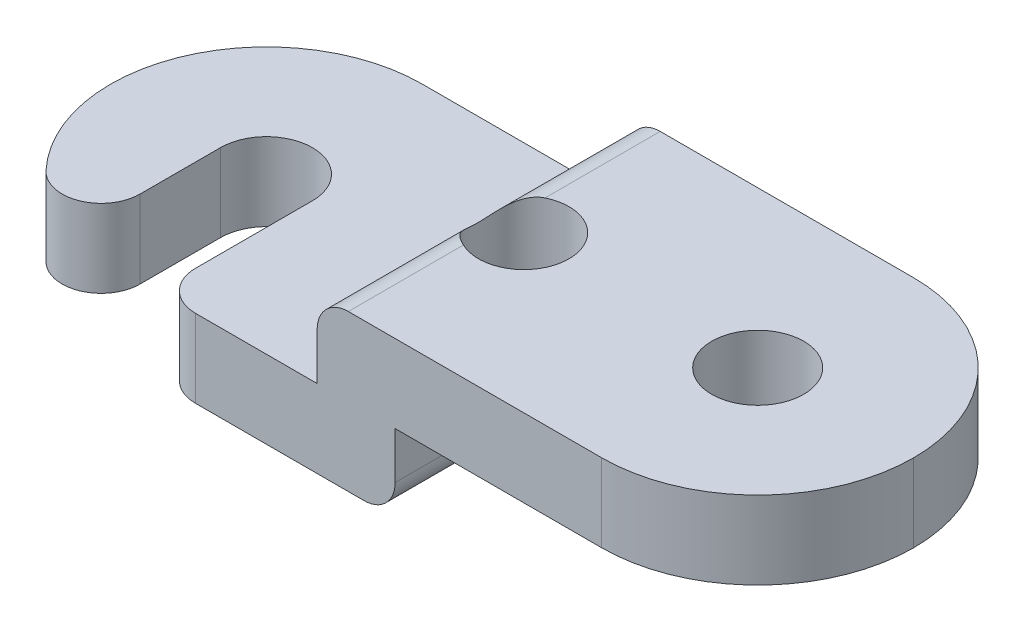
ISO-10303-21;
HEADER;
FILE_DESCRIPTION(('STEP AP214'),'2;1');
FILE_NAME('part.step','',(''),(''),'','','');
FILE_SCHEMA(('AUTOMOTIVE_DESIGN { 1 0 10303 214 1 1 1 1 }'));
ENDSEC;
DATA;
#1=APPLICATION_CONTEXT('core data for automotive mechanical design processes');
#2=APPLICATION_PROTOCOL_DEFINITION('international standard','automotive_design',2000,#1);
#3=PRODUCT_CONTEXT('',#1,'mechanical');
#4=PRODUCT('Part','Part','',(#3));
#5=PRODUCT_RELATED_PRODUCT_CATEGORY('part','',(#4));
#6=PRODUCT_DEFINITION_FORMATION('','',#4);
#7=PRODUCT_DEFINITION_CONTEXT('part definition',#1,'design');
#8=PRODUCT_DEFINITION('design','',#6,#7);
#9=PRODUCT_DEFINITION_SHAPE('','',#8);
#10=(LENGTH_UNIT() NAMED_UNIT(*) SI_UNIT(.MILLI.,.METRE.));
#11=(NAMED_UNIT(*) PLANE_ANGLE_UNIT() SI_UNIT($,.RADIAN.));
#12=(NAMED_UNIT(*) SI_UNIT($,.STERADIAN.) SOLID_ANGLE_UNIT());
#13=UNCERTAINTY_MEASURE_WITH_UNIT(LENGTH_MEASURE(1.E-05),#10,'distance_accuracy_value','');
#14=(GEOMETRIC_REPRESENTATION_CONTEXT(3) GLOBAL_UNCERTAINTY_ASSIGNED_CONTEXT((#13)) GLOBAL_UNIT_ASSIGNED_CONTEXT((#10,
#11,#12)) REPRESENTATION_CONTEXT('',''));
#15=CARTESIAN_POINT('',(0.,0.,0.));
#16=DIRECTION('',(0.,0.,1.));
#17=DIRECTION('',(1.,0.,0.));
#18=AXIS2_PLACEMENT_3D('',#15,#16,#17);
#19=CARTESIAN_POINT('',(5.15,2.,2.00000000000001));
#20=DIRECTION('',(0.,0.,-1.));
#21=DIRECTION('',(-1.,0.,0.));
#22=AXIS2_PLACEMENT_3D('',#19,#20,#21);
#23=PLANE('',#22);
#24=DIRECTION('',(1.,0.,0.));
#25=VECTOR('',#24,1.);
#26=CARTESIAN_POINT('',(-0.499999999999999,1.,2.00000000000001));
#27=LINE('',#26,#25);
#28=CARTESIAN_POINT('',(-2.06,1.,2.00000000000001));
#29=VERTEX_POINT('',#28);
#30=CARTESIAN_POINT('',(-0.499999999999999,1.,2.00000000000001));
#31=VERTEX_POINT('',#30);
#32=EDGE_CURVE('E266',#29,#31,#27,.T.);
#33=ORIENTED_EDGE('',*,*,#32,.F.);
#34=DIRECTION('',(0.,1.,0.));
#35=VECTOR('',#34,1.);
#36=CARTESIAN_POINT('',(-2.06,0.,2.00000000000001));
#37=LINE('',#36,#35);
#38=CARTESIAN_POINT('',(-2.06,0.,2.00000000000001));
#39=VERTEX_POINT('',#38);
#40=EDGE_CURVE('E51',#29,#39,#37,.F.);
#41=ORIENTED_EDGE('',*,*,#40,.T.);
#42=DIRECTION('',(1.,0.,0.));
#43=VECTOR('',#42,1.);
#44=CARTESIAN_POINT('',(5.15,0.,2.00000000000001));
#45=LINE('',#44,#43);
#46=CARTESIAN_POINT('',(0.1,0.,2.00000000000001));
#47=VERTEX_POINT('',#46);
#48=EDGE_CURVE('E263',#39,#47,#45,.T.);
#49=ORIENTED_EDGE('',*,*,#48,.T.);
#50=CARTESIAN_POINT('',(0.1,0.4,2.00000000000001));
#51=DIRECTION('',(0.,0.,-1.));
#52=DIRECTION('',(-1.,0.,0.));
#53=AXIS2_PLACEMENT_3D('',#50,#51,#52);
#54=CIRCLE('',#53,0.4);
#55=CARTESIAN_POINT('',(0.5,0.4,2.00000000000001));
#56=VERTEX_POINT('',#55);
#57=EDGE_CURVE('E340',#47,#56,#54,.F.);
#58=ORIENTED_EDGE('',*,*,#57,.T.);
#59=DIRECTION('',(0.,-1.,0.));
#60=VECTOR('',#59,1.);
#61=CARTESIAN_POINT('',(0.5,1.,2.00000000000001));
#62=LINE('',#61,#60);
#63=CARTESIAN_POINT('',(0.5,1.,2.00000000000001));
#64=VERTEX_POINT('',#63);
#65=EDGE_CURVE('E348',#64,#56,#62,.T.);
#66=ORIENTED_EDGE('',*,*,#65,.F.);
#67=DIRECTION('',(-1.,0.,0.));
#68=VECTOR('',#67,1.);
#69=CARTESIAN_POINT('',(3.15,1.,2.00000000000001));
#70=LINE('',#69,#68);
#71=CARTESIAN_POINT('',(3.15,1.,2.00000000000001));
#72=VERTEX_POINT('',#71);
#73=EDGE_CURVE('E192',#72,#64,#70,.T.);
#74=ORIENTED_EDGE('',*,*,#73,.F.);
#75=DIRECTION('',(0.,-1.,0.));
#76=VECTOR('',#75,1.);
#77=CARTESIAN_POINT('',(3.15,2.,2.00000000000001));
#78=LINE('',#77,#76);
#79=CARTESIAN_POINT('',(3.15,2.,2.00000000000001));
#80=VERTEX_POINT('',#79);
#81=EDGE_CURVE('E315',#72,#80,#78,.F.);
#82=ORIENTED_EDGE('',*,*,#81,.T.);
#83=DIRECTION('',(1.,0.,0.));
#84=VECTOR('',#83,1.);
#85=CARTESIAN_POINT('',(5.15,2.,2.00000000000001));
#86=LINE('',#85,#84);
#87=CARTESIAN_POINT('',(-0.0999999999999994,2.,2.00000000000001));
#88=VERTEX_POINT('',#87);
#89=EDGE_CURVE('E302',#88,#80,#86,.T.);
#90=ORIENTED_EDGE('',*,*,#89,.F.);
#91=CARTESIAN_POINT('',(-0.0999999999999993,1.6,2.00000000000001));
#92=DIRECTION('',(0.,0.,-1.));
#93=DIRECTION('',(-1.,0.,0.));
#94=AXIS2_PLACEMENT_3D('',#91,#92,#93);
#95=CIRCLE('',#94,0.4);
#96=CARTESIAN_POINT('',(-0.499999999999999,1.6,2.00000000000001));
#97=VERTEX_POINT('',#96);
#98=EDGE_CURVE('E296',#88,#97,#95,.F.);
#99=ORIENTED_EDGE('',*,*,#98,.T.);
#100=DIRECTION('',(0.,1.,0.));
#101=VECTOR('',#100,1.);
#102=CARTESIAN_POINT('',(-0.499999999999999,1.,2.00000000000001));
#103=LINE('',#102,#101);
#104=EDGE_CURVE('E288',#31,#97,#103,.T.);
#105=ORIENTED_EDGE('',*,*,#104,.F.);
#106=EDGE_LOOP('',(#33,#41,#49,#58,#66,#74,#82,#90,#99,#105));
#107=FACE_BOUND('',#106,.T.);
#108=ADVANCED_FACE('F38',(#107),#23,.F.);
#109=CARTESIAN_POINT('',(-5.15,0.,-1.99999999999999));
#110=DIRECTION('',(0.,1.,0.));
#111=DIRECTION('',(0.,0.,1.));
#112=AXIS2_PLACEMENT_3D('',#109,#110,#111);
#113=PLANE('',#112);
#114=DIRECTION('',(0.,0.,-1.));
#115=VECTOR('',#114,1.);
#116=CARTESIAN_POINT('',(-3.74,0.,-1.99999999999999));
#117=LINE('',#116,#115);
#118=CARTESIAN_POINT('',(-3.74,0.,1.03048532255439));
#119=VERTEX_POINT('',#118);
#120=CARTESIAN_POINT('',(-3.74,0.,0.));
#121=VERTEX_POINT('',#120);
#122=EDGE_CURVE('E207',#119,#121,#117,.T.);
#123=ORIENTED_EDGE('',*,*,#122,.F.);
#124=CARTESIAN_POINT('',(-4.24,0.,1.03048532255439));
#125=DIRECTION('',(0.,1.,0.));
#126=DIRECTION('',(0.,0.,1.));
#127=AXIS2_PLACEMENT_3D('',#124,#125,#126);
#128=CIRCLE('',#127,0.5);
#129=CARTESIAN_POINT('',(-4.60333333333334,0.,1.37398043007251));
#130=VERTEX_POINT('',#129);
#131=EDGE_CURVE('E257',#119,#130,#128,.F.);
#132=ORIENTED_EDGE('',*,*,#131,.T.);
#133=CARTESIAN_POINT('',(-3.15,0.,0.));
#134=DIRECTION('',(0.,1.,0.));
#135=DIRECTION('',(0.,0.,1.));
#136=AXIS2_PLACEMENT_3D('',#133,#134,#135);
#137=CIRCLE('',#136,2.);
#138=CARTESIAN_POINT('',(-5.15,0.,0.));
#139=VERTEX_POINT('',#138);
#140=EDGE_CURVE('E318',#130,#139,#137,.F.);
#141=ORIENTED_EDGE('',*,*,#140,.T.);
#142=CARTESIAN_POINT('',(-3.15,0.,0.));
#143=DIRECTION('',(0.,1.,0.));
#144=DIRECTION('',(0.,0.,1.));
#145=AXIS2_PLACEMENT_3D('',#142,#143,#144);
#146=CIRCLE('',#145,2.);
#147=CARTESIAN_POINT('',(-3.15,0.,-1.99999999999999));
#148=VERTEX_POINT('',#147);
#149=EDGE_CURVE('E322',#139,#148,#146,.F.);
#150=ORIENTED_EDGE('',*,*,#149,.T.);
#151=DIRECTION('',(-1.,0.,0.));
#152=VECTOR('',#151,1.);
#153=CARTESIAN_POINT('',(5.15,0.,-1.99999999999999));
#154=LINE('',#153,#152);
#155=CARTESIAN_POINT('',(0.100000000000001,0.,-1.99999999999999));
#156=VERTEX_POINT('',#155);
#157=EDGE_CURVE('E275',#156,#148,#154,.T.);
#158=ORIENTED_EDGE('',*,*,#157,.F.);
#159=DIRECTION('',(0.,0.,-1.));
#160=VECTOR('',#159,1.);
#161=CARTESIAN_POINT('',(0.100000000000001,0.,-1.99999999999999));
#162=LINE('',#161,#160);
#163=EDGE_CURVE('E236',#156,#47,#162,.F.);
#164=ORIENTED_EDGE('',*,*,#163,.T.);
#165=ORIENTED_EDGE('',*,*,#48,.F.);
#166=CARTESIAN_POINT('',(-2.06,0.,1.50000000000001));
#167=DIRECTION('',(0.,1.,0.));
#168=DIRECTION('',(0.,0.,1.));
#169=AXIS2_PLACEMENT_3D('',#166,#167,#168);
#170=CIRCLE('',#169,0.5);
#171=CARTESIAN_POINT('',(-2.56,0.,1.50000000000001));
#172=VERTEX_POINT('',#171);
#173=EDGE_CURVE('E255',#39,#172,#170,.F.);
#174=ORIENTED_EDGE('',*,*,#173,.T.);
#175=DIRECTION('',(0.,0.,1.));
#176=VECTOR('',#175,1.);
#177=CARTESIAN_POINT('',(-2.56,0.,-1.99999999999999));
#178=LINE('',#177,#176);
#179=CARTESIAN_POINT('',(-2.56,0.,0.));
#180=VERTEX_POINT('',#179);
#181=EDGE_CURVE('E214',#180,#172,#178,.T.);
#182=ORIENTED_EDGE('',*,*,#181,.F.);
#183=CARTESIAN_POINT('',(-3.15,0.,0.));
#184=DIRECTION('',(0.,1.,0.));
#185=DIRECTION('',(0.,0.,1.));
#186=AXIS2_PLACEMENT_3D('',#183,#184,#185);
#187=CIRCLE('',#186,0.59);
#188=EDGE_CURVE('E198',#180,#121,#187,.T.);
#189=ORIENTED_EDGE('',*,*,#188,.T.);
#190=EDGE_LOOP('',(#123,#132,#141,#150,#158,#164,#165,#174,#182,#189));
#191=FACE_BOUND('',#190,.T.);
#192=ADVANCED_FACE('F271',(#191),#113,.F.);
#193=CARTESIAN_POINT('',(-3.15,2.,0.));
#194=DIRECTION('',(0.,-1.,0.));
#195=DIRECTION('',(0.,0.,-1.));
#196=AXIS2_PLACEMENT_3D('',#193,#194,#195);
#197=CYLINDRICAL_SURFACE('',#196,2.);
#198=ORIENTED_EDGE('',*,*,#140,.F.);
#199=DIRECTION('',(0.,-1.,0.));
#200=VECTOR('',#199,1.);
#201=CARTESIAN_POINT('',(-4.60333333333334,2.,1.37398043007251));
#202=LINE('',#201,#200);
#203=CARTESIAN_POINT('',(-4.60333333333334,1.,1.37398043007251));
#204=VERTEX_POINT('',#203);
#205=EDGE_CURVE('E246',#130,#204,#202,.F.);
#206=ORIENTED_EDGE('',*,*,#205,.T.);
#207=CARTESIAN_POINT('',(-3.15,1.,0.));
#208=DIRECTION('',(0.,1.,0.));
#209=DIRECTION('',(0.,0.,-1.));
#210=AXIS2_PLACEMENT_3D('',#207,#208,#209);
#211=CIRCLE('',#210,2.);
#212=CARTESIAN_POINT('',(-5.15,1.,0.));
#213=VERTEX_POINT('',#212);
#214=EDGE_CURVE('E352',#213,#204,#211,.T.);
#215=ORIENTED_EDGE('',*,*,#214,.F.);
#216=DIRECTION('',(0.,-1.,0.));
#217=VECTOR('',#216,1.);
#218=CARTESIAN_POINT('',(-5.15,2.,0.));
#219=LINE('',#218,#217);
#220=EDGE_CURVE('E298',#139,#213,#219,.F.);
#221=ORIENTED_EDGE('',*,*,#220,.F.);
#222=EDGE_LOOP('',(#198,#206,#215,#221));
#223=FACE_BOUND('',#222,.T.);
#224=ADVANCED_FACE('F365',(#223),#197,.T.);
#225=CARTESIAN_POINT('',(-3.15,1.,0.));
#226=DIRECTION('',(0.,-1.,0.));
#227=DIRECTION('',(0.,0.,-1.));
#228=AXIS2_PLACEMENT_3D('',#225,#226,#227);
#229=PLANE('',#228);
#230=ORIENTED_EDGE('',*,*,#214,.T.);
#231=CARTESIAN_POINT('',(-4.24,1.,1.03048532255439));
#232=DIRECTION('',(0.,-1.,0.));
#233=DIRECTION('',(0.,0.,-1.));
#234=AXIS2_PLACEMENT_3D('',#231,#232,#233);
#235=CIRCLE('',#234,0.5);
#236=CARTESIAN_POINT('',(-3.74,1.,1.03048532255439));
#237=VERTEX_POINT('',#236);
#238=EDGE_CURVE('E251',#204,#237,#235,.F.);
#239=ORIENTED_EDGE('',*,*,#238,.T.);
#240=DIRECTION('',(0.,0.,1.));
#241=VECTOR('',#240,1.);
#242=CARTESIAN_POINT('',(-3.74,1.,0.));
#243=LINE('',#242,#241);
#244=CARTESIAN_POINT('',(-3.74,1.,0.));
#245=VERTEX_POINT('',#244);
#246=EDGE_CURVE('E211',#245,#237,#243,.T.);
#247=ORIENTED_EDGE('',*,*,#246,.F.);
#248=CARTESIAN_POINT('',(-3.15,1.,0.));
#249=DIRECTION('',(0.,-1.,0.));
#250=DIRECTION('',(0.,0.,-1.));
#251=AXIS2_PLACEMENT_3D('',#248,#249,#250);
#252=CIRCLE('',#251,0.59);
#253=CARTESIAN_POINT('',(-2.56,1.,0.));
#254=VERTEX_POINT('',#253);
#255=EDGE_CURVE('E200',#245,#254,#252,.T.);
#256=ORIENTED_EDGE('',*,*,#255,.T.);
#257=DIRECTION('',(0.,0.,-1.));
#258=VECTOR('',#257,1.);
#259=CARTESIAN_POINT('',(-2.56,1.,0.));
#260=LINE('',#259,#258);
#261=CARTESIAN_POINT('',(-2.56,1.,1.50000000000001));
#262=VERTEX_POINT('',#261);
#263=EDGE_CURVE('E217',#262,#254,#260,.T.);
#264=ORIENTED_EDGE('',*,*,#263,.F.);
#265=CARTESIAN_POINT('',(-2.06,1.,1.50000000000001));
#266=DIRECTION('',(0.,-1.,0.));
#267=DIRECTION('',(0.,0.,-1.));
#268=AXIS2_PLACEMENT_3D('',#265,#266,#267);
#269=CIRCLE('',#268,0.5);
#270=EDGE_CURVE('E249',#262,#29,#269,.F.);
#271=ORIENTED_EDGE('',*,*,#270,.T.);
#272=ORIENTED_EDGE('',*,*,#32,.T.);
#273=DIRECTION('',(0.,0.,-1.));
#274=VECTOR('',#273,1.);
#275=CARTESIAN_POINT('',(-0.5,1.,-1.99999999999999));
#276=LINE('',#275,#274);
#277=CARTESIAN_POINT('',(-0.5,1.,-1.99999999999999));
#278=VERTEX_POINT('',#277);
#279=EDGE_CURVE('E280',#31,#278,#276,.T.);
#280=ORIENTED_EDGE('',*,*,#279,.T.);
#281=DIRECTION('',(-1.,0.,0.));
#282=VECTOR('',#281,1.);
#283=CARTESIAN_POINT('',(-3.15,1.,-1.99999999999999));
#284=LINE('',#283,#282);
#285=CARTESIAN_POINT('',(-3.15,1.,-1.99999999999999));
#286=VERTEX_POINT('',#285);
#287=EDGE_CURVE('E292',#278,#286,#284,.T.);
#288=ORIENTED_EDGE('',*,*,#287,.T.);
#289=EDGE_CURVE('E282',#286,#213,#211,.T.);
#290=ORIENTED_EDGE('',*,*,#289,.T.);
#291=EDGE_LOOP('',(#230,#239,#247,#256,#264,#271,#272,#280,#288,#290));
#292=FACE_BOUND('',#291,.T.);
#293=ADVANCED_FACE('F239',(#292),#229,.F.);
#294=CARTESIAN_POINT('',(-3.15,11.5,0.));
#295=DIRECTION('',(0.,-1.,0.));
#296=DIRECTION('',(0.,0.,-1.));
#297=AXIS2_PLACEMENT_3D('',#294,#295,#296);
#298=CYLINDRICAL_SURFACE('',#297,0.59);
#299=DIRECTION('',(0.,-1.,0.));
#300=VECTOR('',#299,1.);
#301=CARTESIAN_POINT('',(-3.74,11.5,0.));
#302=LINE('',#301,#300);
#303=EDGE_CURVE('E235',#121,#245,#302,.F.);
#304=ORIENTED_EDGE('',*,*,#303,.F.);
#305=ORIENTED_EDGE('',*,*,#188,.F.);
#306=DIRECTION('',(0.,-1.,0.));
#307=VECTOR('',#306,1.);
#308=CARTESIAN_POINT('',(-2.56,11.5,0.));
#309=LINE('',#308,#307);
#310=EDGE_CURVE('E224',#180,#254,#309,.F.);
#311=ORIENTED_EDGE('',*,*,#310,.T.);
#312=ORIENTED_EDGE('',*,*,#255,.F.);
#313=EDGE_LOOP('',(#304,#305,#311,#312));
#314=FACE_BOUND('',#313,.T.);
#315=ADVANCED_FACE('F233',(#314),#298,.F.);
#316=CARTESIAN_POINT('',(3.15,2.,0.));
#317=DIRECTION('',(0.,-1.,0.));
#318=DIRECTION('',(0.,0.,-1.));
#319=AXIS2_PLACEMENT_3D('',#316,#317,#318);
#320=CYLINDRICAL_SURFACE('',#319,2.);
#321=ORIENTED_EDGE('',*,*,#81,.F.);
#322=CARTESIAN_POINT('',(3.15000000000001,1.,0.));
#323=DIRECTION('',(0.,-1.,0.));
#324=DIRECTION('',(0.,0.,-1.));
#325=AXIS2_PLACEMENT_3D('',#322,#323,#324);
#326=CIRCLE('',#325,2.);
#327=CARTESIAN_POINT('',(5.15000000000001,1.,0.));
#328=VERTEX_POINT('',#327);
#329=EDGE_CURVE('E195',#328,#72,#326,.T.);
#330=ORIENTED_EDGE('',*,*,#329,.F.);
#331=DIRECTION('',(0.,-1.,0.));
#332=VECTOR('',#331,1.);
#333=CARTESIAN_POINT('',(5.15,2.,0.));
#334=LINE('',#333,#332);
#335=CARTESIAN_POINT('',(5.15,2.,0.));
#336=VERTEX_POINT('',#335);
#337=EDGE_CURVE('E276',#336,#328,#334,.T.);
#338=ORIENTED_EDGE('',*,*,#337,.F.);
#339=CARTESIAN_POINT('',(3.15,2.,0.));
#340=DIRECTION('',(0.,1.,0.));
#341=DIRECTION('',(0.,0.,1.));
#342=AXIS2_PLACEMENT_3D('',#339,#340,#341);
#343=CIRCLE('',#342,2.);
#344=EDGE_CURVE('E311',#80,#336,#343,.T.);
#345=ORIENTED_EDGE('',*,*,#344,.F.);
#346=EDGE_LOOP('',(#321,#330,#338,#345));
#347=FACE_BOUND('',#346,.T.);
#348=ADVANCED_FACE('F396',(#347),#320,.T.);
#349=CARTESIAN_POINT('',(3.15,2.,0.));
#350=DIRECTION('',(0.,-1.,0.));
#351=DIRECTION('',(0.,0.,-1.));
#352=AXIS2_PLACEMENT_3D('',#349,#350,#351);
#353=CYLINDRICAL_SURFACE('',#352,2.);
#354=ORIENTED_EDGE('',*,*,#337,.T.);
#355=CARTESIAN_POINT('',(3.15,1.,-1.99999999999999));
#356=VERTEX_POINT('',#355);
#357=EDGE_CURVE('E355',#356,#328,#326,.T.);
#358=ORIENTED_EDGE('',*,*,#357,.F.);
#359=DIRECTION('',(0.,-1.,0.));
#360=VECTOR('',#359,1.);
#361=CARTESIAN_POINT('',(3.15,2.,-1.99999999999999));
#362=LINE('',#361,#360);
#363=CARTESIAN_POINT('',(3.15,2.,-1.99999999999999));
#364=VERTEX_POINT('',#363);
#365=EDGE_CURVE('E306',#364,#356,#362,.T.);
#366=ORIENTED_EDGE('',*,*,#365,.F.);
#367=CARTESIAN_POINT('',(3.15,2.,0.));
#368=DIRECTION('',(0.,1.,0.));
#369=DIRECTION('',(0.,0.,1.));
#370=AXIS2_PLACEMENT_3D('',#367,#368,#369);
#371=CIRCLE('',#370,2.);
#372=EDGE_CURVE('E313',#336,#364,#371,.T.);
#373=ORIENTED_EDGE('',*,*,#372,.F.);
#374=EDGE_LOOP('',(#354,#358,#366,#373));
#375=FACE_BOUND('',#374,.T.);
#376=ADVANCED_FACE('F393',(#375),#353,.T.);
#377=CARTESIAN_POINT('',(5.15,2.,-1.99999999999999));
#378=DIRECTION('',(0.,0.,1.));
#379=DIRECTION('',(1.,0.,0.));
#380=AXIS2_PLACEMENT_3D('',#377,#378,#379);
#381=PLANE('',#380);
#382=DIRECTION('',(0.,1.,0.));
#383=VECTOR('',#382,1.);
#384=CARTESIAN_POINT('',(-0.5,1.,-1.99999999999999));
#385=LINE('',#384,#383);
#386=CARTESIAN_POINT('',(-0.5,1.6,-1.99999999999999));
#387=VERTEX_POINT('',#386);
#388=EDGE_CURVE('E291',#278,#387,#385,.T.);
#389=ORIENTED_EDGE('',*,*,#388,.T.);
#390=CARTESIAN_POINT('',(-0.1,1.6,-1.99999999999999));
#391=DIRECTION('',(0.,0.,1.));
#392=DIRECTION('',(1.,0.,0.));
#393=AXIS2_PLACEMENT_3D('',#390,#391,#392);
#394=CIRCLE('',#393,0.4);
#395=CARTESIAN_POINT('',(-0.1,2.,-1.99999999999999));
#396=VERTEX_POINT('',#395);
#397=EDGE_CURVE('E334',#387,#396,#394,.F.);
#398=ORIENTED_EDGE('',*,*,#397,.T.);
#399=DIRECTION('',(-1.,0.,0.));
#400=VECTOR('',#399,1.);
#401=CARTESIAN_POINT('',(5.15,2.,-1.99999999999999));
#402=LINE('',#401,#400);
#403=EDGE_CURVE('E304',#364,#396,#402,.T.);
#404=ORIENTED_EDGE('',*,*,#403,.F.);
#405=ORIENTED_EDGE('',*,*,#365,.T.);
#406=DIRECTION('',(1.,0.,0.));
#407=VECTOR('',#406,1.);
#408=CARTESIAN_POINT('',(0.500000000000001,1.,-1.99999999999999));
#409=LINE('',#408,#407);
#410=CARTESIAN_POINT('',(0.500000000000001,1.,-1.99999999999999));
#411=VERTEX_POINT('',#410);
#412=EDGE_CURVE('E194',#411,#356,#409,.T.);
#413=ORIENTED_EDGE('',*,*,#412,.F.);
#414=DIRECTION('',(0.,-1.,0.));
#415=VECTOR('',#414,1.);
#416=CARTESIAN_POINT('',(0.500000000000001,1.,-1.99999999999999));
#417=LINE('',#416,#415);
#418=CARTESIAN_POINT('',(0.500000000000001,0.4,-1.99999999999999));
#419=VERTEX_POINT('',#418);
#420=EDGE_CURVE('E346',#411,#419,#417,.T.);
#421=ORIENTED_EDGE('',*,*,#420,.T.);
#422=CARTESIAN_POINT('',(0.100000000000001,0.4,-1.99999999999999));
#423=DIRECTION('',(0.,0.,1.));
#424=DIRECTION('',(1.,0.,0.));
#425=AXIS2_PLACEMENT_3D('',#422,#423,#424);
#426=CIRCLE('',#425,0.4);
#427=EDGE_CURVE('E332',#419,#156,#426,.F.);
#428=ORIENTED_EDGE('',*,*,#427,.T.);
#429=ORIENTED_EDGE('',*,*,#157,.T.);
#430=DIRECTION('',(0.,-1.,0.));
#431=VECTOR('',#430,1.);
#432=CARTESIAN_POINT('',(-3.15,2.,-1.99999999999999));
#433=LINE('',#432,#431);
#434=EDGE_CURVE('E325',#148,#286,#433,.F.);
#435=ORIENTED_EDGE('',*,*,#434,.T.);
#436=ORIENTED_EDGE('',*,*,#287,.F.);
#437=EDGE_LOOP('',(#389,#398,#404,#405,#413,#421,#428,#429,#435,#436));
#438=FACE_BOUND('',#437,.T.);
#439=ADVANCED_FACE('F351',(#438),#381,.F.);
#440=CARTESIAN_POINT('',(-5.15,2.,-1.99999999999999));
#441=DIRECTION('',(0.,1.,0.));
#442=DIRECTION('',(0.,0.,1.));
#443=AXIS2_PLACEMENT_3D('',#440,#441,#442);
#444=PLANE('',#443);
#445=CARTESIAN_POINT('',(0.150000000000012,2.,0.));
#446=DIRECTION('',(0.,1.,0.));
#447=DIRECTION('',(0.,0.,1.));
#448=AXIS2_PLACEMENT_3D('',#445,#446,#447);
#449=CIRCLE('',#448,0.58);
#450=CARTESIAN_POINT('',(-0.0999999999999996,2.,0.523354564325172));
#451=VERTEX_POINT('',#450);
#452=CARTESIAN_POINT('',(-0.0999999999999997,2.,-0.523354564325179));
#453=VERTEX_POINT('',#452);
#454=EDGE_CURVE('E63',#451,#453,#449,.T.);
#455=ORIENTED_EDGE('',*,*,#454,.F.);
#456=DIRECTION('',(0.,0.,-1.));
#457=VECTOR('',#456,1.);
#458=CARTESIAN_POINT('',(-0.0999999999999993,2.,2.00000000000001));
#459=LINE('',#458,#457);
#460=EDGE_CURVE('E336',#451,#88,#459,.F.);
#461=ORIENTED_EDGE('',*,*,#460,.T.);
#462=ORIENTED_EDGE('',*,*,#89,.T.);
#463=ORIENTED_EDGE('',*,*,#344,.T.);
#464=ORIENTED_EDGE('',*,*,#372,.T.);
#465=ORIENTED_EDGE('',*,*,#403,.T.);
#466=EDGE_CURVE('E337',#396,#453,#459,.F.);
#467=ORIENTED_EDGE('',*,*,#466,.T.);
#468=EDGE_LOOP('',(#455,#461,#462,#463,#464,#465,#467));
#469=FACE_BOUND('',#468,.T.);
#470=CARTESIAN_POINT('',(3.15000000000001,2.,0.));
#471=DIRECTION('',(0.,-1.,0.));
#472=DIRECTION('',(0.,0.,-1.));
#473=AXIS2_PLACEMENT_3D('',#470,#471,#472);
#474=CIRCLE('',#473,0.59);
#475=CARTESIAN_POINT('',(3.15000000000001,2.,-0.589999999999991));
#476=VERTEX_POINT('',#475);
#477=EDGE_CURVE('E206',#476,#476,#474,.T.);
#478=ORIENTED_EDGE('',*,*,#477,.T.);
#479=EDGE_LOOP('',(#478));
#480=FACE_BOUND('',#479,.T.);
#481=ADVANCED_FACE('F403',(#469,#480),#444,.T.);
#482=CARTESIAN_POINT('',(-3.15,2.,0.));
#483=DIRECTION('',(0.,-1.,0.));
#484=DIRECTION('',(0.,0.,-1.));
#485=AXIS2_PLACEMENT_3D('',#482,#483,#484);
#486=CYLINDRICAL_SURFACE('',#485,2.);
#487=ORIENTED_EDGE('',*,*,#289,.F.);
#488=ORIENTED_EDGE('',*,*,#434,.F.);
#489=ORIENTED_EDGE('',*,*,#149,.F.);
#490=ORIENTED_EDGE('',*,*,#220,.T.);
#491=EDGE_LOOP('',(#487,#488,#489,#490));
#492=FACE_BOUND('',#491,.T.);
#493=ADVANCED_FACE('F368',(#492),#486,.T.);
#494=CARTESIAN_POINT('',(-0.5,1.,-1.99999999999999));
#495=DIRECTION('',(1.,0.,0.));
#496=DIRECTION('',(0.,0.,-1.));
#497=AXIS2_PLACEMENT_3D('',#494,#495,#496);
#498=PLANE('',#497);
#499=ORIENTED_EDGE('',*,*,#104,.T.);
#500=DIRECTION('',(0.,0.,-1.));
#501=VECTOR('',#500,1.);
#502=CARTESIAN_POINT('',(-0.5,1.6,-1.99999999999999));
#503=LINE('',#502,#501);
#504=EDGE_CURVE('E328',#97,#387,#503,.T.);
#505=ORIENTED_EDGE('',*,*,#504,.T.);
#506=ORIENTED_EDGE('',*,*,#388,.F.);
#507=ORIENTED_EDGE('',*,*,#279,.F.);
#508=EDGE_LOOP('',(#499,#505,#506,#507));
#509=FACE_BOUND('',#508,.T.);
#510=ADVANCED_FACE('F286',(#509),#498,.F.);
#511=CARTESIAN_POINT('',(0.5,1.,2.00000000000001));
#512=DIRECTION('',(-1.,0.,0.));
#513=DIRECTION('',(0.,0.,1.));
#514=AXIS2_PLACEMENT_3D('',#511,#512,#513);
#515=PLANE('',#514);
#516=ORIENTED_EDGE('',*,*,#65,.T.);
#517=DIRECTION('',(0.,0.,-1.));
#518=VECTOR('',#517,1.);
#519=CARTESIAN_POINT('',(0.5,0.4,2.00000000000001));
#520=LINE('',#519,#518);
#521=EDGE_CURVE('E342',#56,#419,#520,.T.);
#522=ORIENTED_EDGE('',*,*,#521,.T.);
#523=ORIENTED_EDGE('',*,*,#420,.F.);
#524=DIRECTION('',(0.,0.,-1.));
#525=VECTOR('',#524,1.);
#526=CARTESIAN_POINT('',(0.5,1.,2.00000000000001));
#527=LINE('',#526,#525);
#528=CARTESIAN_POINT('',(0.500000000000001,1.,-0.462493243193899));
#529=VERTEX_POINT('',#528);
#530=EDGE_CURVE('E187',#529,#411,#527,.T.);
#531=ORIENTED_EDGE('',*,*,#530,.F.);
#532=CARTESIAN_POINT('',(0.500000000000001,1.,0.462493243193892));
#533=VERTEX_POINT('',#532);
#534=EDGE_CURVE('E173',#533,#529,#527,.T.);
#535=ORIENTED_EDGE('',*,*,#534,.F.);
#536=EDGE_CURVE('E184',#64,#533,#527,.T.);
#537=ORIENTED_EDGE('',*,*,#536,.F.);
#538=EDGE_LOOP('',(#516,#522,#523,#531,#535,#537));
#539=FACE_BOUND('',#538,.T.);
#540=ADVANCED_FACE('F183',(#539),#515,.F.);
#541=CARTESIAN_POINT('',(3.15000000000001,1.,0.));
#542=DIRECTION('',(0.,-1.,0.));
#543=DIRECTION('',(0.,0.,-1.));
#544=AXIS2_PLACEMENT_3D('',#541,#542,#543);
#545=PLANE('',#544);
#546=CARTESIAN_POINT('',(0.150000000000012,1.,0.));
#547=DIRECTION('',(0.,-1.,0.));
#548=DIRECTION('',(0.,0.,-1.));
#549=AXIS2_PLACEMENT_3D('',#546,#547,#548);
#550=CIRCLE('',#549,0.58);
#551=EDGE_CURVE('E175',#529,#533,#550,.T.);
#552=ORIENTED_EDGE('',*,*,#551,.F.);
#553=ORIENTED_EDGE('',*,*,#530,.T.);
#554=ORIENTED_EDGE('',*,*,#412,.T.);
#555=ORIENTED_EDGE('',*,*,#357,.T.);
#556=ORIENTED_EDGE('',*,*,#329,.T.);
#557=ORIENTED_EDGE('',*,*,#73,.T.);
#558=ORIENTED_EDGE('',*,*,#536,.T.);
#559=EDGE_LOOP('',(#552,#553,#554,#555,#556,#557,#558));
#560=FACE_BOUND('',#559,.T.);
#561=CARTESIAN_POINT('',(3.15000000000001,1.,0.));
#562=DIRECTION('',(0.,-1.,0.));
#563=DIRECTION('',(0.,0.,-1.));
#564=AXIS2_PLACEMENT_3D('',#561,#562,#563);
#565=CIRCLE('',#564,0.59);
#566=CARTESIAN_POINT('',(3.15000000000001,1.,-0.589999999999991));
#567=VERTEX_POINT('',#566);
#568=EDGE_CURVE('E203',#567,#567,#565,.T.);
#569=ORIENTED_EDGE('',*,*,#568,.F.);
#570=EDGE_LOOP('',(#569));
#571=FACE_BOUND('',#570,.T.);
#572=ADVANCED_FACE('F189',(#560,#571),#545,.T.);
#573=CARTESIAN_POINT('',(-0.1,1.6,-1.99999999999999));
#574=DIRECTION('',(0.,0.,1.));
#575=DIRECTION('',(1.,0.,0.));
#576=AXIS2_PLACEMENT_3D('',#573,#574,#575);
#577=CYLINDRICAL_SURFACE('',#576,0.4);
#578=CARTESIAN_POINT('',(-0.0999999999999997,2.,-0.523354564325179));
#579=CARTESIAN_POINT('',(-0.123011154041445,2.0000026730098,-0.512391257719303));
#580=CARTESIAN_POINT('',(-0.145146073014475,1.99802038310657,-0.499929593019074));
#581=CARTESIAN_POINT('',(-0.187054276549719,1.990980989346,-0.472656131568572));
#582=CARTESIAN_POINT('',(-0.206851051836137,1.98595826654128,-0.457871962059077));
#583=CARTESIAN_POINT('',(-0.248936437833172,1.97206592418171,-0.422144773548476));
#584=CARTESIAN_POINT('',(-0.270489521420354,1.96252876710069,-0.400609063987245));
#585=CARTESIAN_POINT('',(-0.309683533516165,1.94136643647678,-0.354967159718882));
#586=CARTESIAN_POINT('',(-0.327301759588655,1.92972981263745,-0.330847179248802));
#587=CARTESIAN_POINT('',(-0.358959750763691,1.90552600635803,-0.279799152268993));
#588=CARTESIAN_POINT('',(-0.372894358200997,1.89294248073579,-0.252814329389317));
#589=CARTESIAN_POINT('',(-0.396523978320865,1.86898525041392,-0.196567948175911));
#590=CARTESIAN_POINT('',(-0.406230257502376,1.85760839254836,-0.167312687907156));
#591=CARTESIAN_POINT('',(-0.418262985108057,1.84241743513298,-0.11773747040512));
#592=CARTESIAN_POINT('',(-0.421991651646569,1.83736505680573,-0.0981518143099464));
#593=CARTESIAN_POINT('',(-0.427415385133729,1.82982922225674,-0.0582562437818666));
#594=CARTESIAN_POINT('',(-0.429118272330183,1.82733589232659,-0.0379494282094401));
#595=CARTESIAN_POINT('',(-0.430355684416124,1.82553727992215,0.00301878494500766));
#596=CARTESIAN_POINT('',(-0.429875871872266,1.82625307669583,0.0236816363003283));
#597=CARTESIAN_POINT('',(-0.426764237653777,1.8307193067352,0.064543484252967));
#598=CARTESIAN_POINT('',(-0.424125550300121,1.83447942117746,0.0847407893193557));
#599=CARTESIAN_POINT('',(-0.415398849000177,1.84615927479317,0.132410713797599));
#600=CARTESIAN_POINT('',(-0.408333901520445,1.8551575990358,0.159424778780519));
#601=CARTESIAN_POINT('',(-0.390740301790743,1.8750405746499,0.211568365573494));
#602=CARTESIAN_POINT('',(-0.380201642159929,1.88593063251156,0.236692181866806));
#603=CARTESIAN_POINT('',(-0.354881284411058,1.90878604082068,0.286955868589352));
#604=CARTESIAN_POINT('',(-0.339841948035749,1.92077105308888,0.31195745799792));
#605=CARTESIAN_POINT('',(-0.30588530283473,1.94355358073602,0.359756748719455));
#606=CARTESIAN_POINT('',(-0.28697350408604,1.9543527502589,0.382557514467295));
#607=CARTESIAN_POINT('',(-0.249287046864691,1.971559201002,0.421371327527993));
#608=CARTESIAN_POINT('',(-0.231193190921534,1.97841194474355,0.437844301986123));
#609=CARTESIAN_POINT('',(-0.192609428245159,1.98964560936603,0.46863780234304));
#610=CARTESIAN_POINT('',(-0.172127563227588,1.994034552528,0.482965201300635));
#611=CARTESIAN_POINT('',(-0.134310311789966,1.99886914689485,0.505905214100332));
#612=CARTESIAN_POINT('',(-0.11738908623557,2.00000549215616,0.51506590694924));
#613=CARTESIAN_POINT('',(-0.100000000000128,2.00000000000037,0.523354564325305));
#614=B_SPLINE_CURVE_WITH_KNOTS('',3,(#578,#579,#580,#581,#582,#583,#584,#585,#586,#587,#588,
#589,#590,#591,#592,#593,#594,#595,#596,#597,#598,#599,#600,#601,#602,#603,#604,#605,#606,#607,
#608,#609,#610,#611,#612,#613),.UNSPECIFIED.,.F.,.F.,(4,2,2,2,2,2,2,2,2,2,2,2,2,2,2,2,2,4),(0.,
0.0761208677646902,0.151396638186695,0.246673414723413,0.342486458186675,0.44079506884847,
0.538840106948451,0.600337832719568,0.661597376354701,0.723259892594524,0.785119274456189,
0.872645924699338,0.960426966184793,1.05474848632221,1.14893671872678,1.22490951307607,
1.30063347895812,1.3583025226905),.UNSPECIFIED.);
#615=EDGE_CURVE('E11',#453,#451,#614,.T.);
#616=ORIENTED_EDGE('',*,*,#615,.F.);
#617=ORIENTED_EDGE('',*,*,#466,.F.);
#618=ORIENTED_EDGE('',*,*,#397,.F.);
#619=ORIENTED_EDGE('',*,*,#504,.F.);
#620=ORIENTED_EDGE('',*,*,#98,.F.);
#621=ORIENTED_EDGE('',*,*,#460,.F.);
#622=EDGE_LOOP('',(#616,#617,#618,#619,#620,#621));
#623=FACE_BOUND('',#622,.T.);
#624=ADVANCED_FACE('F405',(#623),#577,.T.);
#625=CARTESIAN_POINT('',(0.1,0.4,2.00000000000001));
#626=DIRECTION('',(0.,0.,-1.));
#627=DIRECTION('',(-1.,0.,0.));
#628=AXIS2_PLACEMENT_3D('',#625,#626,#627);
#629=CYLINDRICAL_SURFACE('',#628,0.4);
#630=ORIENTED_EDGE('',*,*,#57,.F.);
#631=ORIENTED_EDGE('',*,*,#163,.F.);
#632=ORIENTED_EDGE('',*,*,#427,.F.);
#633=ORIENTED_EDGE('',*,*,#521,.F.);
#634=EDGE_LOOP('',(#630,#631,#632,#633));
#635=FACE_BOUND('',#634,.T.);
#636=ADVANCED_FACE('F409',(#635),#629,.T.);
#637=CARTESIAN_POINT('',(3.15000000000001,2.,0.));
#638=DIRECTION('',(0.,-1.,0.));
#639=DIRECTION('',(0.,0.,-1.));
#640=AXIS2_PLACEMENT_3D('',#637,#638,#639);
#641=CYLINDRICAL_SURFACE('',#640,0.59);
#642=ORIENTED_EDGE('',*,*,#477,.F.);
#643=EDGE_LOOP('',(#642));
#644=FACE_BOUND('',#643,.T.);
#645=ORIENTED_EDGE('',*,*,#568,.T.);
#646=EDGE_LOOP('',(#645));
#647=FACE_BOUND('',#646,.T.);
#648=ADVANCED_FACE('F381',(#644,#647),#641,.F.);
#649=CARTESIAN_POINT('',(-2.56,-15.2862254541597,0.));
#650=DIRECTION('',(-1.,0.,0.));
#651=DIRECTION('',(0.,0.,1.));
#652=AXIS2_PLACEMENT_3D('',#649,#650,#651);
#653=PLANE('',#652);
#654=ORIENTED_EDGE('',*,*,#181,.T.);
#655=DIRECTION('',(0.,1.,0.));
#656=VECTOR('',#655,1.);
#657=CARTESIAN_POINT('',(-2.56,1.,1.50000000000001));
#658=LINE('',#657,#656);
#659=EDGE_CURVE('E227',#172,#262,#658,.T.);
#660=ORIENTED_EDGE('',*,*,#659,.T.);
#661=ORIENTED_EDGE('',*,*,#263,.T.);
#662=ORIENTED_EDGE('',*,*,#310,.F.);
#663=EDGE_LOOP('',(#654,#660,#661,#662));
#664=FACE_BOUND('',#663,.T.);
#665=ADVANCED_FACE('F223',(#664),#653,.T.);
#666=CARTESIAN_POINT('',(-3.74,-15.2862254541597,0.));
#667=DIRECTION('',(1.,0.,0.));
#668=DIRECTION('',(0.,0.,-1.));
#669=AXIS2_PLACEMENT_3D('',#666,#667,#668);
#670=PLANE('',#669);
#671=ORIENTED_EDGE('',*,*,#246,.T.);
#672=DIRECTION('',(0.,-1.,0.));
#673=VECTOR('',#672,1.);
#674=CARTESIAN_POINT('',(-3.74,-15.2862254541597,1.03048532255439));
#675=LINE('',#674,#673);
#676=EDGE_CURVE('E253',#237,#119,#675,.T.);
#677=ORIENTED_EDGE('',*,*,#676,.T.);
#678=ORIENTED_EDGE('',*,*,#122,.T.);
#679=ORIENTED_EDGE('',*,*,#303,.T.);
#680=EDGE_LOOP('',(#671,#677,#678,#679));
#681=FACE_BOUND('',#680,.T.);
#682=ADVANCED_FACE('F374',(#681),#670,.T.);
#683=CARTESIAN_POINT('',(-4.24,2.,1.03048532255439));
#684=DIRECTION('',(0.,-1.,0.));
#685=DIRECTION('',(0.,0.,-1.));
#686=AXIS2_PLACEMENT_3D('',#683,#684,#685);
#687=CYLINDRICAL_SURFACE('',#686,0.5);
#688=ORIENTED_EDGE('',*,*,#131,.F.);
#689=ORIENTED_EDGE('',*,*,#676,.F.);
#690=ORIENTED_EDGE('',*,*,#238,.F.);
#691=ORIENTED_EDGE('',*,*,#205,.F.);
#692=EDGE_LOOP('',(#688,#689,#690,#691));
#693=FACE_BOUND('',#692,.T.);
#694=ADVANCED_FACE('F371',(#693),#687,.T.);
#695=CARTESIAN_POINT('',(-2.06,-15.2862254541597,1.50000000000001));
#696=DIRECTION('',(0.,-1.,0.));
#697=DIRECTION('',(0.,0.,-1.));
#698=AXIS2_PLACEMENT_3D('',#695,#696,#697);
#699=CYLINDRICAL_SURFACE('',#698,0.5);
#700=ORIENTED_EDGE('',*,*,#173,.F.);
#701=ORIENTED_EDGE('',*,*,#40,.F.);
#702=ORIENTED_EDGE('',*,*,#270,.F.);
#703=ORIENTED_EDGE('',*,*,#659,.F.);
#704=EDGE_LOOP('',(#700,#701,#702,#703));
#705=FACE_BOUND('',#704,.T.);
#706=ADVANCED_FACE('F40',(#705),#699,.T.);
#707=CARTESIAN_POINT('',(0.150000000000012,1.,0.));
#708=DIRECTION('',(0.,-1.,0.));
#709=DIRECTION('',(0.,0.,-1.));
#710=AXIS2_PLACEMENT_3D('',#707,#708,#709);
#711=PLANE('',#710);
#712=EDGE_CURVE('E57',#533,#529,#550,.T.);
#713=ORIENTED_EDGE('',*,*,#712,.F.);
#714=ORIENTED_EDGE('',*,*,#534,.T.);
#715=EDGE_LOOP('',(#713,#714));
#716=FACE_BOUND('',#715,.T.);
#717=ADVANCED_FACE('F171',(#716),#711,.F.);
#718=CARTESIAN_POINT('',(0.150000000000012,22.,0.));
#719=DIRECTION('',(0.,-1.,0.));
#720=DIRECTION('',(0.,0.,-1.));
#721=AXIS2_PLACEMENT_3D('',#718,#719,#720);
#722=CYLINDRICAL_SURFACE('',#721,0.58);
#723=ORIENTED_EDGE('',*,*,#454,.T.);
#724=ORIENTED_EDGE('',*,*,#615,.T.);
#725=EDGE_LOOP('',(#723,#724));
#726=FACE_BOUND('',#725,.T.);
#727=ORIENTED_EDGE('',*,*,#551,.T.);
#728=ORIENTED_EDGE('',*,*,#712,.T.);
#729=EDGE_LOOP('',(#727,#728));
#730=FACE_BOUND('',#729,.T.);
#731=ADVANCED_FACE('F177',(#726,#730),#722,.F.);
#732=CLOSED_SHELL('',(#108,#192,#224,#293,#315,#348,#376,#439,#481,#493,#510,#540,#572,#624,
#636,#648,#665,#682,#694,#706,#717,#731));
#733=MANIFOLD_SOLID_BREP('B2',#732);
#734=ADVANCED_BREP_SHAPE_REPRESENTATION('',(#18,#733),#14);
#735=SHAPE_DEFINITION_REPRESENTATION(#9,#734);
ENDSEC;
END-ISO-10303-21;
